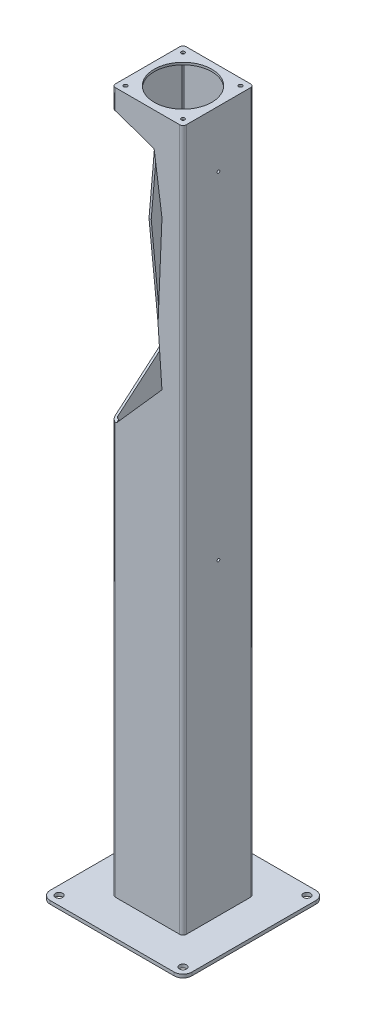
from build123d import *

# Parameters (mm, degrees)
SKETCH1_R                      = 5.207
BOSS_EXTRUDE1_DEPTH            = 4.7752
BOSS_EXTRUDE2_DEPTH            = 1005.84
SHELL2_T                       = -3.175
SKETCH3_R                      = 41.275
CUT_EXTRUDE1_DEPTH             = 1021.778233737
TAP_DRILL_FOR_1_4_20_TAP1_D    = 5.1054
TAP_DRILL_FOR_10_32_TAP1_D     = 4.0386
TAP_DRILL_FOR_10_32_TAP1_DEPTH = 3.175
CUT_EXTRUDE3_DEPTH             = 6.35
CUT_EXTRUDE4_DEPTH             = 6.35


with BuildPart() as part:
    # Sketch1 → Boss-Extrude1 (new body)
    with BuildSketch(Plane(origin=(0, 0, 0), x_dir=(1, 0, 0), z_dir=(0, 1, 0))):
        with BuildLine():
            Line((-88.9, 101.6), (88.9, 101.6))
            ThreePointArc((88.9, 101.6), (97.880256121, 97.880256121), (101.6, 88.9))
            Line((101.6, 88.9), (101.6, -88.9))
            ThreePointArc((101.6, -88.9), (97.880256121, -97.880256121), (88.9, -101.6))
            Line((88.9, -101.6), (-88.9, -101.6))
            ThreePointArc((-88.9, -101.6), (-97.880256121, -97.880256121), (-101.6, -88.9))
            Line((-101.6, -88.9), (-101.6, 88.9))
            ThreePointArc((-101.6, 88.9), (-97.880256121, 97.880256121), (-88.9, 101.6))
        make_face()
        with Locations(Location((-88.9, 88.9, 0), (0, 0, 270))):
            Circle(SKETCH1_R, mode=Mode.SUBTRACT)
        with Locations(Location((88.9, 88.9, 0), (0, 0, 270))):
            Circle(SKETCH1_R, mode=Mode.SUBTRACT)
        with Locations(Location((88.9, -88.9, 0), (0, 0, 270))):
            Circle(SKETCH1_R, mode=Mode.SUBTRACT)
        with Locations(Location((-88.9, -88.9, 0), (0, 0, 270))):
            Circle(SKETCH1_R, mode=Mode.SUBTRACT)
    extrude(amount=BOSS_EXTRUDE1_DEPTH)

    # Sketch2 → Boss-Extrude2 (add)
    with BuildSketch(Plane(origin=(0, 4.7752, 0), x_dir=(1, 0, 0), z_dir=(0, 1, 0))):
        with BuildLine():
            Line((-45.974, 50.8), (45.974, 50.8))
            ThreePointArc((45.974, 50.8), (49.386497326, 49.386497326), (50.8, 45.974))
            Line((50.8, 45.974), (50.8, -45.974))
            ThreePointArc((50.8, -45.974), (49.386497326, -49.386497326), (45.974, -50.8))
            Line((45.974, -50.8), (-45.974, -50.8))
            ThreePointArc((-45.974, -50.8), (-49.386497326, -49.386497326), (-50.8, -45.974))
            Line((-50.8, -45.974), (-50.8, 45.974))
            ThreePointArc((-50.8, 45.974), (-49.386497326, 49.386497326), (-45.974, 50.8))
        make_face()
    extrude(amount=BOSS_EXTRUDE2_DEPTH)

    # Shell2
    shell2_openings = [part.faces().sort_by_distance(p)[0] for p in [
        (0, 0, 0),
    ]]
    offset(amount=SHELL2_T, openings=shell2_openings, kind=Kind.INTERSECTION)

    # Sketch3 → Cut-Extrude1 (cut, through all)
    with BuildSketch(Plane(origin=(0, 1010.6152, 0), x_dir=(1, 0, 0), z_dir=(0, 1, 0))):
        with Locations(Location((0, 0, 0), (0, 0, 270))):
            Circle(SKETCH3_R)
    extrude(amount=-CUT_EXTRUDE1_DEPTH, mode=Mode.SUBTRACT)

    # Tap Drill for 1_4-20 Tap1 (through all)
    with Locations(Plane(origin=(0, 1010.6152, 0), x_dir=(1, 0, 0), z_dir=(0, 1, 0))):
        with Locations((-41.275, 41.275), (41.275, 41.275), (41.275, -41.275), (-41.275, -41.275)):
            Hole(TAP_DRILL_FOR_1_4_20_TAP1_D / 2)

    # Tap Drill for _10-32 Tap1
    with Locations(Plane(origin=(50.8, 0, 0), x_dir=(0, 0, -1), z_dir=(1, 0, 0))):
        with Locations((0, 929.3352), (0, 446.7352)):
            Hole(TAP_DRILL_FOR_10_32_TAP1_D / 2, depth=TAP_DRILL_FOR_10_32_TAP1_DEPTH)

    # Sketch13 → Cut-Extrude3 (cut)
    with BuildSketch(Plane.ZY.offset(50.8)):
        Polygon((50.8, 981.73420546), (6.829671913, 968.333663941), (-10.893624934, 913.434671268), (-2.03197651, 819.630880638), (-17.81003346, 653.637076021), (50.8, 595.082415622), align=None)
    extrude(amount=-CUT_EXTRUDE3_DEPTH, mode=Mode.SUBTRACT)

    # Sketch14 → Cut-Extrude4 (cut)
    with BuildSketch(Plane.XY.offset(50.8)):
        Polygon((-45.212, 981.73420546), (9.412504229, 962.275883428), (20.615018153, 882.422066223), (15.013761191, 747.937897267), (20.615018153, 668.520690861), (-44.45, 595.082415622), align=None)
    extrude(amount=-CUT_EXTRUDE4_DEPTH, mode=Mode.SUBTRACT)


solid = part.part
